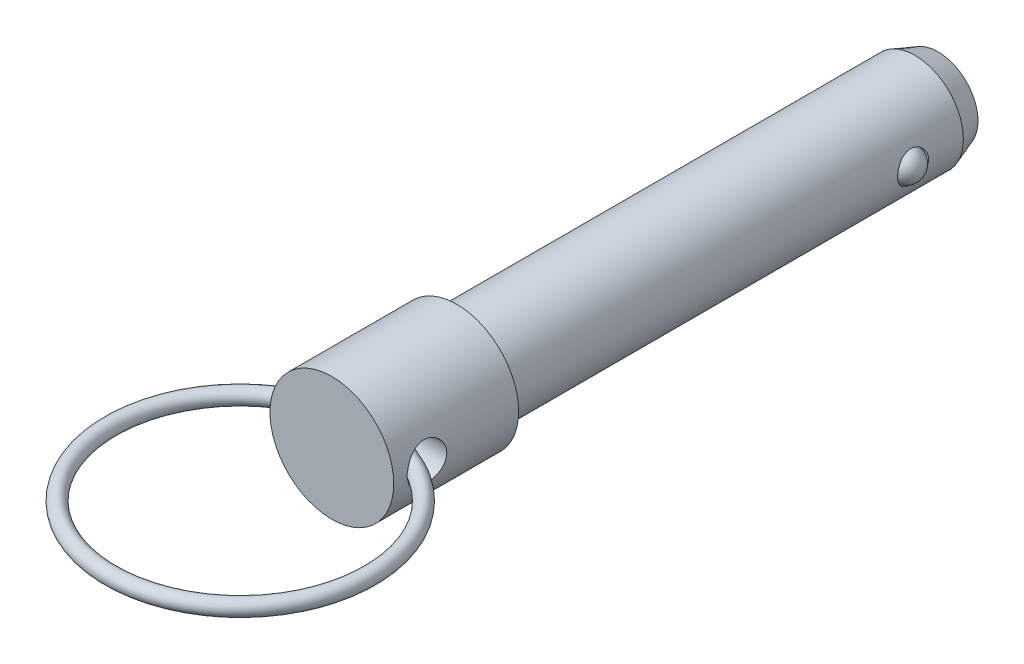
ISO-10303-21;
HEADER;
FILE_DESCRIPTION(('STEP AP214'),'2;1');
FILE_NAME('part.step','',(''),(''),'','','');
FILE_SCHEMA(('AUTOMOTIVE_DESIGN { 1 0 10303 214 1 1 1 1 }'));
ENDSEC;
DATA;
#1=APPLICATION_CONTEXT('core data for automotive mechanical design processes');
#2=APPLICATION_PROTOCOL_DEFINITION('international standard','automotive_design',2000,#1);
#3=PRODUCT_CONTEXT('',#1,'mechanical');
#4=PRODUCT('Part','Part','',(#3));
#5=PRODUCT_RELATED_PRODUCT_CATEGORY('part','',(#4));
#6=PRODUCT_DEFINITION_FORMATION('','',#4);
#7=PRODUCT_DEFINITION_CONTEXT('part definition',#1,'design');
#8=PRODUCT_DEFINITION('design','',#6,#7);
#9=PRODUCT_DEFINITION_SHAPE('','',#8);
#10=(LENGTH_UNIT() NAMED_UNIT(*) SI_UNIT(.MILLI.,.METRE.));
#11=(NAMED_UNIT(*) PLANE_ANGLE_UNIT() SI_UNIT($,.RADIAN.));
#12=(NAMED_UNIT(*) SI_UNIT($,.STERADIAN.) SOLID_ANGLE_UNIT());
#13=UNCERTAINTY_MEASURE_WITH_UNIT(LENGTH_MEASURE(1.E-05),#10,'distance_accuracy_value','');
#14=(GEOMETRIC_REPRESENTATION_CONTEXT(3) GLOBAL_UNCERTAINTY_ASSIGNED_CONTEXT((#13)) GLOBAL_UNIT_ASSIGNED_CONTEXT((#10,
#11,#12)) REPRESENTATION_CONTEXT('',''));
#15=CARTESIAN_POINT('',(0.,0.,0.));
#16=DIRECTION('',(0.,0.,1.));
#17=DIRECTION('',(1.,0.,0.));
#18=AXIS2_PLACEMENT_3D('',#15,#16,#17);
#19=CARTESIAN_POINT('',(7.9375,0.,9.398));
#20=DIRECTION('',(-1.,0.,0.));
#21=DIRECTION('',(0.,0.,-1.));
#22=AXIS2_PLACEMENT_3D('',#19,#20,#21);
#23=CYLINDRICAL_SURFACE('',#22,2.0193);
#24=CARTESIAN_POINT('',(-6.3502,0.292157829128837,11.3960531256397));
#25=CARTESIAN_POINT('',(-6.33446408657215,0.262361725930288,11.4004344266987));
#26=CARTESIAN_POINT('',(-6.32102794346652,0.231225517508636,11.4042829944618));
#27=CARTESIAN_POINT('',(-6.2992523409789,0.167152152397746,11.4106204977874));
#28=CARTESIAN_POINT('',(-6.29090461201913,0.13421801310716,11.413111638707));
#29=CARTESIAN_POINT('',(-6.27972917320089,0.0672091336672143,11.4164621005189));
#30=CARTESIAN_POINT('',(-6.27692077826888,0.0331308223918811,11.4173157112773));
#31=CARTESIAN_POINT('',(-6.27702601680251,-0.0350157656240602,11.4172838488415));
#32=CARTESIAN_POINT('',(-6.27993956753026,-0.0690840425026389,11.4163984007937));
#33=CARTESIAN_POINT('',(-6.2912662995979,-0.135748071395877,11.4130038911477));
#34=CARTESIAN_POINT('',(-6.29960976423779,-0.168356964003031,11.4105154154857));
#35=CARTESIAN_POINT('',(-6.32127848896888,-0.231802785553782,11.404211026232));
#36=CARTESIAN_POINT('',(-6.33461136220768,-0.2626369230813,11.4003930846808));
#37=CARTESIAN_POINT('',(-6.3502,-0.292157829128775,11.3960531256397));
#38=B_SPLINE_CURVE_WITH_KNOTS('',3,(#24,#25,#26,#27,#28,#29,#30,#31,#32,#33,#34,#35,#36,#37),
.UNSPECIFIED.,.F.,.F.,(4,2,2,2,2,2,4),(0.,0.101899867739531,0.203633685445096,0.305721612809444,
0.407808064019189,0.508608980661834,0.60956433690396),.UNSPECIFIED.);
#39=CARTESIAN_POINT('',(-6.3438349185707,0.279747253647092,11.3978284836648));
#40=VERTEX_POINT('',#39);
#41=CARTESIAN_POINT('',(-6.34383491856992,-0.279747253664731,11.3978284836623));
#42=VERTEX_POINT('',#41);
#43=EDGE_CURVE('E40',#40,#42,#38,.T.);
#44=ORIENTED_EDGE('',*,*,#43,.F.);
#45=CARTESIAN_POINT('',(-6.35,0.,11.4173));
#46=CARTESIAN_POINT('',(-6.34999578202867,-0.110312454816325,11.417293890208));
#47=CARTESIAN_POINT('',(-6.34709412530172,-0.22074185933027,11.4082188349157));
#48=CARTESIAN_POINT('',(-6.3357852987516,-0.438477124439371,11.3722159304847));
#49=CARTESIAN_POINT('',(-6.3273687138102,-0.545777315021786,11.3452575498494));
#50=CARTESIAN_POINT('',(-6.30595235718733,-0.753914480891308,11.2744960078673));
#51=CARTESIAN_POINT('',(-6.29296259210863,-0.854765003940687,11.2307296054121));
#52=CARTESIAN_POINT('',(-6.26374009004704,-1.04765917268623,11.1277235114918));
#53=CARTESIAN_POINT('',(-6.247507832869,-1.13970411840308,11.0684861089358));
#54=CARTESIAN_POINT('',(-6.21293601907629,-1.31536123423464,10.9342184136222));
#55=CARTESIAN_POINT('',(-6.19454917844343,-1.39865352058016,10.8587818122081));
#56=CARTESIAN_POINT('',(-6.15801023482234,-1.5516474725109,10.6951184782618));
#57=CARTESIAN_POINT('',(-6.13985819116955,-1.62134576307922,10.606888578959));
#58=CARTESIAN_POINT('',(-6.1053372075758,-1.74691684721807,10.4173629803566));
#59=CARTESIAN_POINT('',(-6.08902613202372,-1.80238797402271,10.315789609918));
#60=CARTESIAN_POINT('',(-6.06074349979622,-1.89532725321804,10.104153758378));
#61=CARTESIAN_POINT('',(-6.0487707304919,-1.93280043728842,9.99409365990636));
#62=CARTESIAN_POINT('',(-6.03101341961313,-1.98750760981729,9.77220930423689));
#63=CARTESIAN_POINT('',(-6.02504825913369,-2.00533395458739,9.66054596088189));
#64=CARTESIAN_POINT('',(-6.01944581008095,-2.02209234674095,9.43566621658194));
#65=CARTESIAN_POINT('',(-6.01980677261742,-2.02102961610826,9.32245025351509));
#66=CARTESIAN_POINT('',(-6.02665663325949,-2.00050250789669,9.10261826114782));
#67=CARTESIAN_POINT('',(-6.03289303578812,-1.98179631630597,8.99592223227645));
#68=CARTESIAN_POINT('',(-6.05038018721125,-1.92774435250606,8.78726894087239));
#69=CARTESIAN_POINT('',(-6.06163151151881,-1.89239667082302,8.68531222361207));
#70=CARTESIAN_POINT('',(-6.08807105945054,-1.80553890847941,8.48724541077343));
#71=CARTESIAN_POINT('',(-6.1033159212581,-1.75379385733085,8.39124624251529));
#72=CARTESIAN_POINT('',(-6.13599834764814,-1.63577635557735,8.20905256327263));
#73=CARTESIAN_POINT('',(-6.15343637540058,-1.56950083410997,8.12286013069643));
#74=CARTESIAN_POINT('',(-6.18954615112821,-1.42061516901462,7.95845350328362));
#75=CARTESIAN_POINT('',(-6.20823733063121,-1.33738288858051,7.88080597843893));
#76=CARTESIAN_POINT('',(-6.2440320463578,-1.15881168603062,7.74040227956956));
#77=CARTESIAN_POINT('',(-6.26113489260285,-1.0634675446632,7.6776525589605));
#78=CARTESIAN_POINT('',(-6.29201953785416,-0.86223092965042,7.56842117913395));
#79=CARTESIAN_POINT('',(-6.30576997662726,-0.756251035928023,7.5220914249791));
#80=CARTESIAN_POINT('',(-6.32815272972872,-0.537579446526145,7.448167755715));
#81=CARTESIAN_POINT('',(-6.3367955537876,-0.424902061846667,7.4205353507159));
#82=CARTESIAN_POINT('',(-6.34491251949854,-0.259333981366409,7.39474486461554));
#83=CARTESIAN_POINT('',(-6.3468148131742,-0.207677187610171,7.38873516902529));
#84=CARTESIAN_POINT('',(-6.34935954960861,-0.10402226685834,7.38071129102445));
#85=CARTESIAN_POINT('',(-6.35000198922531,-0.052024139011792,7.37869711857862));
#86=CARTESIAN_POINT('',(-6.34999578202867,0.110312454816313,7.37870610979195));
#87=CARTESIAN_POINT('',(-6.34709412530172,0.220741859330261,7.38778116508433));
#88=CARTESIAN_POINT('',(-6.3357852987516,0.438477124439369,7.42378406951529));
#89=CARTESIAN_POINT('',(-6.3273687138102,0.545777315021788,7.45074245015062));
#90=CARTESIAN_POINT('',(-6.30595235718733,0.753914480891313,7.5215039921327));
#91=CARTESIAN_POINT('',(-6.29296259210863,0.85476500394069,7.56527039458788));
#92=CARTESIAN_POINT('',(-6.26374009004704,1.04765917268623,7.66827648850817));
#93=CARTESIAN_POINT('',(-6.247507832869,1.13970411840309,7.72751389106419));
#94=CARTESIAN_POINT('',(-6.21293601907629,1.31536123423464,7.86178158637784));
#95=CARTESIAN_POINT('',(-6.19454917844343,1.39865352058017,7.93721818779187));
#96=CARTESIAN_POINT('',(-6.15801023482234,1.55164747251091,8.10088152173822));
#97=CARTESIAN_POINT('',(-6.13985819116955,1.62134576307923,8.18911142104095));
#98=CARTESIAN_POINT('',(-6.1053372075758,1.74691684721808,8.37863701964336));
#99=CARTESIAN_POINT('',(-6.08902613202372,1.80238797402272,8.48021039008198));
#100=CARTESIAN_POINT('',(-6.06074349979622,1.89532725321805,8.69184624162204));
#101=CARTESIAN_POINT('',(-6.0487707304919,1.93280043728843,8.80190634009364));
#102=CARTESIAN_POINT('',(-6.03101341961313,1.9875076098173,9.02379069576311));
#103=CARTESIAN_POINT('',(-6.02504825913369,2.0053339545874,9.13545403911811));
#104=CARTESIAN_POINT('',(-6.01944581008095,2.02209234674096,9.36033378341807));
#105=CARTESIAN_POINT('',(-6.01980677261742,2.02102961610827,9.47354974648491));
#106=CARTESIAN_POINT('',(-6.02665663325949,2.0005025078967,9.69338173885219));
#107=CARTESIAN_POINT('',(-6.03289303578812,1.98179631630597,9.80007776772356));
#108=CARTESIAN_POINT('',(-6.05038018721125,1.92774435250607,10.0087310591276));
#109=CARTESIAN_POINT('',(-6.06163151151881,1.89239667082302,10.1106877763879));
#110=CARTESIAN_POINT('',(-6.08807105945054,1.80553890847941,10.3087545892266));
#111=CARTESIAN_POINT('',(-6.1033159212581,1.75379385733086,10.4047537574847));
#112=CARTESIAN_POINT('',(-6.13599834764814,1.63577635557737,10.5869474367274));
#113=CARTESIAN_POINT('',(-6.15343637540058,1.56950083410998,10.6731398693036));
#114=CARTESIAN_POINT('',(-6.18954615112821,1.42061516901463,10.8375464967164));
#115=CARTESIAN_POINT('',(-6.20823733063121,1.33738288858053,10.9151940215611));
#116=CARTESIAN_POINT('',(-6.2440320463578,1.15881168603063,11.0555977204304));
#117=CARTESIAN_POINT('',(-6.26113489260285,1.06346754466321,11.1183474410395));
#118=CARTESIAN_POINT('',(-6.29201953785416,0.862230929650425,11.227578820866));
#119=CARTESIAN_POINT('',(-6.30576997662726,0.756251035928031,11.2739085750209));
#120=CARTESIAN_POINT('',(-6.32815272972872,0.537579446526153,11.347832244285));
#121=CARTESIAN_POINT('',(-6.3367955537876,0.424902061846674,11.3754646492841));
#122=CARTESIAN_POINT('',(-6.34491251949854,0.259333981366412,11.4012551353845));
#123=CARTESIAN_POINT('',(-6.3468148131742,0.207677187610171,11.4072648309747));
#124=CARTESIAN_POINT('',(-6.34935954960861,0.104022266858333,11.4152887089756));
#125=CARTESIAN_POINT('',(-6.35000198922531,0.0520241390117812,11.4173028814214));
#126=CARTESIAN_POINT('',(-6.35,0.,11.4173));
#127=B_SPLINE_CURVE_WITH_KNOTS('',3,(#45,#46,#47,#48,#49,#50,#51,#52,#53,#54,#55,#56,#57,#58,
#59,#60,#61,#62,#63,#64,#65,#66,#67,#68,#69,#70,#71,#72,#73,#74,#75,#76,#77,#78,#79,#80,#81,#82,
#83,#84,#85,#86,#87,#88,#89,#90,#91,#92,#93,#94,#95,#96,#97,#98,#99,#100,#101,#102,#103,#104,
#105,#106,#107,#108,#109,#110,#111,#112,#113,#114,#115,#116,#117,#118,#119,#120,#121,#122,#123,
#124,#125,#126),.UNSPECIFIED.,.T.,.F.,(4,2,2,2,2,2,2,2,2,2,2,2,2,2,2,2,2,2,2,2,2,2,2,2,2,2,2,2,
2,2,2,2,2,2,2,2,2,2,2,2,4),(0.,0.33073688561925,0.662039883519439,0.992622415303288,
1.32315606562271,1.66322530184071,2.00337886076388,2.35228054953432,2.70108463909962,
3.0390572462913,3.37693642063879,3.70092724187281,4.02495524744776,4.35385413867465,
4.68282260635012,5.02727904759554,5.37188442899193,5.71959937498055,6.06659632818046,
6.22257380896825,6.37855167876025,6.70928856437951,7.04059156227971,7.37117409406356,
7.70170774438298,8.04177698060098,8.38193053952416,8.73083222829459,9.07963631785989,
9.41760892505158,9.75548809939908,10.0794789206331,10.403506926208,10.7324058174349,
11.0613742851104,11.4058307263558,11.7504361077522,12.0981510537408,12.4451480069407,
12.6011254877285,12.7571033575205),.UNSPECIFIED.);
#128=EDGE_CURVE('E66',#42,#40,#127,.T.);
#129=ORIENTED_EDGE('',*,*,#128,.F.);
#130=EDGE_LOOP('',(#44,#129));
#131=FACE_BOUND('',#130,.T.);
#132=CARTESIAN_POINT('',(6.3502,-0.292157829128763,11.3960531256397));
#133=CARTESIAN_POINT('',(6.33446408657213,-0.262361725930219,11.4004344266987));
#134=CARTESIAN_POINT('',(6.3210279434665,-0.231225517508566,11.4042829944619));
#135=CARTESIAN_POINT('',(6.29925234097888,-0.167152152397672,11.4106204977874));
#136=CARTESIAN_POINT('',(6.29090461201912,-0.134218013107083,11.413111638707));
#137=CARTESIAN_POINT('',(6.27972917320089,-0.0672091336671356,11.4164621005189));
#138=CARTESIAN_POINT('',(6.27692077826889,-0.0331308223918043,11.4173157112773));
#139=CARTESIAN_POINT('',(6.27702601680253,0.0350157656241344,11.4172838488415));
#140=CARTESIAN_POINT('',(6.27993956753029,0.0690840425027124,11.4163984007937));
#141=CARTESIAN_POINT('',(6.29126629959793,0.135748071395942,11.4130038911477));
#142=CARTESIAN_POINT('',(6.29960976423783,0.168356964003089,11.4105154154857));
#143=CARTESIAN_POINT('',(6.32127848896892,0.23180278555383,11.4042110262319));
#144=CARTESIAN_POINT('',(6.33461136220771,0.262636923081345,11.4003930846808));
#145=CARTESIAN_POINT('',(6.3502,0.292157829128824,11.3960531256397));
#146=B_SPLINE_CURVE_WITH_KNOTS('',3,(#132,#133,#134,#135,#136,#137,#138,#139,#140,#141,#142,
#143,#144,#145),.UNSPECIFIED.,.F.,.F.,(4,2,2,2,2,2,4),(0.,0.101899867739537,0.203633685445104,
0.305721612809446,0.40780806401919,0.508608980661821,0.609564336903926),.UNSPECIFIED.);
#147=CARTESIAN_POINT('',(6.3438349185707,-0.279747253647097,11.3978284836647));
#148=VERTEX_POINT('',#147);
#149=CARTESIAN_POINT('',(6.3438349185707,0.279747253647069,11.3978284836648));
#150=VERTEX_POINT('',#149);
#151=EDGE_CURVE('E33',#148,#150,#146,.T.);
#152=ORIENTED_EDGE('',*,*,#151,.F.);
#153=CARTESIAN_POINT('',(6.35,0.,7.3787));
#154=CARTESIAN_POINT('',(6.34999578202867,-0.110312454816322,7.37870610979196));
#155=CARTESIAN_POINT('',(6.34709412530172,-0.220741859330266,7.38778116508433));
#156=CARTESIAN_POINT('',(6.3357852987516,-0.438477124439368,7.42378406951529));
#157=CARTESIAN_POINT('',(6.32736871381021,-0.545777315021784,7.45074245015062));
#158=CARTESIAN_POINT('',(6.30595235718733,-0.753914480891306,7.5215039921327));
#159=CARTESIAN_POINT('',(6.29296259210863,-0.854765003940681,7.56527039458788));
#160=CARTESIAN_POINT('',(6.26374009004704,-1.04765917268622,7.66827648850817));
#161=CARTESIAN_POINT('',(6.24750783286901,-1.13970411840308,7.72751389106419));
#162=CARTESIAN_POINT('',(6.2129360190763,-1.31536123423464,7.86178158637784));
#163=CARTESIAN_POINT('',(6.19454917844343,-1.39865352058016,7.93721818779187));
#164=CARTESIAN_POINT('',(6.15801023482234,-1.5516474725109,8.10088152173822));
#165=CARTESIAN_POINT('',(6.13985819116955,-1.62134576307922,8.18911142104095));
#166=CARTESIAN_POINT('',(6.1053372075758,-1.74691684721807,8.37863701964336));
#167=CARTESIAN_POINT('',(6.08902613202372,-1.80238797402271,8.48021039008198));
#168=CARTESIAN_POINT('',(6.06074349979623,-1.89532725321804,8.69184624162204));
#169=CARTESIAN_POINT('',(6.04877073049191,-1.93280043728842,8.80190634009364));
#170=CARTESIAN_POINT('',(6.03101341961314,-1.9875076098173,9.02379069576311));
#171=CARTESIAN_POINT('',(6.02504825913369,-2.00533395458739,9.13545403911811));
#172=CARTESIAN_POINT('',(6.01944581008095,-2.02209234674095,9.36033378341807));
#173=CARTESIAN_POINT('',(6.01980677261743,-2.02102961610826,9.47354974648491));
#174=CARTESIAN_POINT('',(6.0266566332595,-2.00050250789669,9.69338173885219));
#175=CARTESIAN_POINT('',(6.03289303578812,-1.98179631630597,9.80007776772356));
#176=CARTESIAN_POINT('',(6.05038018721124,-1.92774435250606,10.0087310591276));
#177=CARTESIAN_POINT('',(6.06163151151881,-1.89239667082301,10.1106877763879));
#178=CARTESIAN_POINT('',(6.08807105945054,-1.80553890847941,10.3087545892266));
#179=CARTESIAN_POINT('',(6.1033159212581,-1.75379385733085,10.4047537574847));
#180=CARTESIAN_POINT('',(6.13599834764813,-1.63577635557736,10.5869474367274));
#181=CARTESIAN_POINT('',(6.15343637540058,-1.56950083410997,10.6731398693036));
#182=CARTESIAN_POINT('',(6.18954615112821,-1.42061516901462,10.8375464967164));
#183=CARTESIAN_POINT('',(6.2082373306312,-1.33738288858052,10.9151940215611));
#184=CARTESIAN_POINT('',(6.2440320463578,-1.15881168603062,11.0555977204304));
#185=CARTESIAN_POINT('',(6.26113489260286,-1.0634675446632,11.1183474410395));
#186=CARTESIAN_POINT('',(6.29201953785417,-0.862230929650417,11.227578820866));
#187=CARTESIAN_POINT('',(6.30576997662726,-0.756251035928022,11.2739085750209));
#188=CARTESIAN_POINT('',(6.32815272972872,-0.537579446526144,11.347832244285));
#189=CARTESIAN_POINT('',(6.33679555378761,-0.424902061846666,11.3754646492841));
#190=CARTESIAN_POINT('',(6.34491251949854,-0.259333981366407,11.4012551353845));
#191=CARTESIAN_POINT('',(6.3468148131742,-0.207677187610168,11.4072648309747));
#192=CARTESIAN_POINT('',(6.34935954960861,-0.104022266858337,11.4152887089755));
#193=CARTESIAN_POINT('',(6.35000198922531,-0.0520241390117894,11.4173028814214));
#194=CARTESIAN_POINT('',(6.34999578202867,0.110312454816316,11.417293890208));
#195=CARTESIAN_POINT('',(6.34709412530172,0.220741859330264,11.4082188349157));
#196=CARTESIAN_POINT('',(6.3357852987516,0.438477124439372,11.3722159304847));
#197=CARTESIAN_POINT('',(6.32736871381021,0.545777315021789,11.3452575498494));
#198=CARTESIAN_POINT('',(6.30595235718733,0.753914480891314,11.2744960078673));
#199=CARTESIAN_POINT('',(6.29296259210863,0.854765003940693,11.2307296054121));
#200=CARTESIAN_POINT('',(6.26374009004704,1.04765917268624,11.1277235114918));
#201=CARTESIAN_POINT('',(6.24750783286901,1.13970411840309,11.0684861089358));
#202=CARTESIAN_POINT('',(6.2129360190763,1.31536123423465,10.9342184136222));
#203=CARTESIAN_POINT('',(6.19454917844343,1.39865352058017,10.8587818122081));
#204=CARTESIAN_POINT('',(6.15801023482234,1.55164747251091,10.6951184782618));
#205=CARTESIAN_POINT('',(6.13985819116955,1.62134576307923,10.606888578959));
#206=CARTESIAN_POINT('',(6.1053372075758,1.74691684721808,10.4173629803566));
#207=CARTESIAN_POINT('',(6.08902613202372,1.80238797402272,10.315789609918));
#208=CARTESIAN_POINT('',(6.06074349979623,1.89532725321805,10.104153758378));
#209=CARTESIAN_POINT('',(6.04877073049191,1.93280043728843,9.99409365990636));
#210=CARTESIAN_POINT('',(6.03101341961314,1.9875076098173,9.77220930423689));
#211=CARTESIAN_POINT('',(6.02504825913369,2.0053339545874,9.66054596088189));
#212=CARTESIAN_POINT('',(6.01944581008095,2.02209234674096,9.43566621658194));
#213=CARTESIAN_POINT('',(6.01980677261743,2.02102961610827,9.3224502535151));
#214=CARTESIAN_POINT('',(6.0266566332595,2.00050250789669,9.10261826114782));
#215=CARTESIAN_POINT('',(6.03289303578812,1.98179631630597,8.99592223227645));
#216=CARTESIAN_POINT('',(6.05038018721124,1.92774435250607,8.78726894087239));
#217=CARTESIAN_POINT('',(6.06163151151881,1.89239667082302,8.68531222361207));
#218=CARTESIAN_POINT('',(6.08807105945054,1.80553890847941,8.48724541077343));
#219=CARTESIAN_POINT('',(6.1033159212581,1.75379385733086,8.39124624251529));
#220=CARTESIAN_POINT('',(6.13599834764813,1.63577635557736,8.20905256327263));
#221=CARTESIAN_POINT('',(6.15343637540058,1.56950083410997,8.12286013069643));
#222=CARTESIAN_POINT('',(6.18954615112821,1.42061516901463,7.95845350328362));
#223=CARTESIAN_POINT('',(6.2082373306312,1.33738288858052,7.88080597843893));
#224=CARTESIAN_POINT('',(6.2440320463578,1.15881168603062,7.74040227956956));
#225=CARTESIAN_POINT('',(6.26113489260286,1.06346754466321,7.6776525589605));
#226=CARTESIAN_POINT('',(6.29201953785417,0.862230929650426,7.56842117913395));
#227=CARTESIAN_POINT('',(6.30576997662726,0.756251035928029,7.5220914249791));
#228=CARTESIAN_POINT('',(6.32815272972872,0.537579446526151,7.448167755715));
#229=CARTESIAN_POINT('',(6.33679555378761,0.424902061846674,7.4205353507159));
#230=CARTESIAN_POINT('',(6.34491251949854,0.259333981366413,7.39474486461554));
#231=CARTESIAN_POINT('',(6.3468148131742,0.207677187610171,7.38873516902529));
#232=CARTESIAN_POINT('',(6.34935954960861,0.104022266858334,7.38071129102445));
#233=CARTESIAN_POINT('',(6.35000198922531,0.0520241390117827,7.37869711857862));
#234=CARTESIAN_POINT('',(6.35,0.,7.3787));
#235=B_SPLINE_CURVE_WITH_KNOTS('',3,(#153,#154,#155,#156,#157,#158,#159,#160,#161,#162,#163,
#164,#165,#166,#167,#168,#169,#170,#171,#172,#173,#174,#175,#176,#177,#178,#179,#180,#181,#182,
#183,#184,#185,#186,#187,#188,#189,#190,#191,#192,#193,#194,#195,#196,#197,#198,#199,#200,#201,
#202,#203,#204,#205,#206,#207,#208,#209,#210,#211,#212,#213,#214,#215,#216,#217,#218,#219,#220,
#221,#222,#223,#224,#225,#226,#227,#228,#229,#230,#231,#232,#233,#234),.UNSPECIFIED.,.T.,.F.,(4,
2,2,2,2,2,2,2,2,2,2,2,2,2,2,2,2,2,2,2,2,2,2,2,2,2,2,2,2,2,2,2,2,2,2,2,2,2,2,2,4),(0.,
0.330736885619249,0.662039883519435,0.992622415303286,1.32315606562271,1.66322530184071,
2.00337886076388,2.35228054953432,2.70108463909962,3.03905724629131,3.3769364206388,
3.70092724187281,4.02495524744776,4.35385413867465,4.68282260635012,5.02727904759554,
5.37188442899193,5.71959937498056,6.06659632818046,6.22257380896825,6.37855167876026,
6.70928856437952,7.04059156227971,7.37117409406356,7.70170774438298,8.04177698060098,
8.38193053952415,8.73083222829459,9.07963631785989,9.41760892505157,9.75548809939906,
10.0794789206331,10.403506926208,10.7324058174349,11.0613742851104,11.4058307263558,
11.7504361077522,12.0981510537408,12.4451480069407,12.6011254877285,12.7571033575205),.UNSPECIFIED.);
#236=EDGE_CURVE('E62',#150,#148,#235,.T.);
#237=ORIENTED_EDGE('',*,*,#236,.F.);
#238=EDGE_LOOP('',(#152,#237));
#239=FACE_BOUND('',#238,.T.);
#240=ADVANCED_FACE('F14',(#131,#239),#23,.F.);
#241=CARTESIAN_POINT('',(0.,0.,-34.39922));
#242=DIRECTION('',(0.,0.,-1.));
#243=DIRECTION('',(1.,0.,0.));
#244=AXIS2_PLACEMENT_3D('',#241,#242,#243);
#245=CYLINDRICAL_SURFACE('',#244,6.35);
#246=ORIENTED_EDGE('',*,*,#236,.T.);
#247=CARTESIAN_POINT('',(6.34665582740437,-0.206057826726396,9.6663673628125));
#248=CARTESIAN_POINT('',(6.34528498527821,-0.248279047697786,9.67828523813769));
#249=CARTESIAN_POINT('',(6.34352249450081,-0.289459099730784,9.69386090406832));
#250=CARTESIAN_POINT('',(6.33942011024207,-0.368543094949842,9.7317801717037));
#251=CARTESIAN_POINT('',(6.33708008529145,-0.406446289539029,9.75412531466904));
#252=CARTESIAN_POINT('',(6.33209241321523,-0.477899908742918,9.8047666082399));
#253=CARTESIAN_POINT('',(6.32944535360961,-0.511458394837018,9.83305147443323));
#254=CARTESIAN_POINT('',(6.32412241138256,-0.573540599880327,9.89467297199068));
#255=CARTESIAN_POINT('',(6.32144652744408,-0.602064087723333,9.92800983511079));
#256=CARTESIAN_POINT('',(6.31623478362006,-0.654523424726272,10.0000464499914));
#257=CARTESIAN_POINT('',(6.31370785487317,-0.678248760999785,10.0388997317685));
#258=CARTESIAN_POINT('',(6.30914807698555,-0.719430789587,10.1198151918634));
#259=CARTESIAN_POINT('',(6.30711537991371,-0.736885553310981,10.1618783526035));
#260=CARTESIAN_POINT('',(6.30356963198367,-0.76665206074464,10.2517585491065));
#261=CARTESIAN_POINT('',(6.3021147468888,-0.778407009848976,10.2997618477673));
#262=CARTESIAN_POINT('',(6.30009638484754,-0.794575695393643,10.3969997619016));
#263=CARTESIAN_POINT('',(6.2995332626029,-0.798986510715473,10.4462348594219));
#264=CARTESIAN_POINT('',(6.29930439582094,-0.800791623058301,10.5499764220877));
#265=CARTESIAN_POINT('',(6.29973840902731,-0.79740583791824,10.6044969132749));
#266=CARTESIAN_POINT('',(6.30162771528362,-0.782332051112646,10.7123814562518));
#267=CARTESIAN_POINT('',(6.30308376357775,-0.770637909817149,10.7657446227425));
#268=CARTESIAN_POINT('',(6.30699495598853,-0.737976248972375,10.8743575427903));
#269=CARTESIAN_POINT('',(6.30952256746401,-0.716323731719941,10.9294001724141));
#270=CARTESIAN_POINT('',(6.31524450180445,-0.663986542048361,11.0349896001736));
#271=CARTESIAN_POINT('',(6.31843852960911,-0.633305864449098,11.0855383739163));
#272=CARTESIAN_POINT('',(6.32446092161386,-0.569663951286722,11.1714846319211));
#273=CARTESIAN_POINT('',(6.3272488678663,-0.538153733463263,11.2079604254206));
#274=CARTESIAN_POINT('',(6.33270636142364,-0.469583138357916,11.2752665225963));
#275=CARTESIAN_POINT('',(6.3353760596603,-0.432530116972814,11.3061041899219));
#276=CARTESIAN_POINT('',(6.33987873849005,-0.359908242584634,11.3561064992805));
#277=CARTESIAN_POINT('',(6.34177713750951,-0.325092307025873,11.3763560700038));
#278=CARTESIAN_POINT('',(6.34507913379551,-0.252556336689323,11.4108259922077));
#279=CARTESIAN_POINT('',(6.34648300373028,-0.214837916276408,11.4250496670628));
#280=CARTESIAN_POINT('',(6.34863622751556,-0.137224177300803,11.446638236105));
#281=CARTESIAN_POINT('',(6.34938200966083,-0.0973182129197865,11.4539657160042));
#282=CARTESIAN_POINT('',(6.35010496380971,-0.0168334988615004,11.4610716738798));
#283=CARTESIAN_POINT('',(6.35008242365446,0.0237449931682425,11.4608529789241));
#284=CARTESIAN_POINT('',(6.34931136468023,0.100393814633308,11.4532686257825));
#285=CARTESIAN_POINT('',(6.34863038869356,0.136533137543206,11.4465678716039));
#286=CARTESIAN_POINT('',(6.3467164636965,0.207223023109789,11.4274006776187));
#287=CARTESIAN_POINT('',(6.34548344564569,0.241773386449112,11.4149335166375));
#288=CARTESIAN_POINT('',(6.34254165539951,0.309606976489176,11.3844132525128));
#289=CARTESIAN_POINT('',(6.34081891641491,0.342814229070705,11.3661941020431));
#290=CARTESIAN_POINT('',(6.33707366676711,0.406211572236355,11.3251453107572));
#291=CARTESIAN_POINT('',(6.33505103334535,0.436400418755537,11.3023137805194));
#292=CARTESIAN_POINT('',(6.33055131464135,0.497695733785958,11.2491439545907));
#293=CARTESIAN_POINT('',(6.32805141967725,0.528268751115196,11.2181940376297));
#294=CARTESIAN_POINT('',(6.32308163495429,0.584759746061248,11.1523092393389));
#295=CARTESIAN_POINT('',(6.32061176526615,0.610674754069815,11.1173718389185));
#296=CARTESIAN_POINT('',(6.315456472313,0.662038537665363,11.0376631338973));
#297=CARTESIAN_POINT('',(6.31281513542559,0.686522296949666,10.9922657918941));
#298=CARTESIAN_POINT('',(6.30810097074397,0.72856661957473,10.8983369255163));
#299=CARTESIAN_POINT('',(6.30602851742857,0.746122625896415,10.8498033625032));
#300=CARTESIAN_POINT('',(6.30243933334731,0.775896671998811,10.7442183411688));
#301=CARTESIAN_POINT('',(6.30103001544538,0.787122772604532,10.6868803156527));
#302=CARTESIAN_POINT('',(6.29940721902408,0.800007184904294,10.5710986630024));
#303=CARTESIAN_POINT('',(6.29919407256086,0.801662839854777,10.5126547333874));
#304=CARTESIAN_POINT('',(6.30005021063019,0.794909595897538,10.3956729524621));
#305=CARTESIAN_POINT('',(6.30113381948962,0.786388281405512,10.3371413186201));
#306=CARTESIAN_POINT('',(6.30452399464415,0.758730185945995,10.2226628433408));
#307=CARTESIAN_POINT('',(6.30682981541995,0.739599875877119,10.1667144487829));
#308=CARTESIAN_POINT('',(6.31212037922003,0.692916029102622,10.0644672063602));
#309=CARTESIAN_POINT('',(6.31502617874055,0.666266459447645,10.0177527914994));
#310=CARTESIAN_POINT('',(6.32122790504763,0.604592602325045,9.93024699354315));
#311=CARTESIAN_POINT('',(6.32452352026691,0.569574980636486,9.88945093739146));
#312=CARTESIAN_POINT('',(6.33066231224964,0.496394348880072,9.8196791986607));
#313=CARTESIAN_POINT('',(6.3335154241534,0.458999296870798,9.78989736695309));
#314=CARTESIAN_POINT('',(6.33878167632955,0.379383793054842,9.7376345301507));
#315=CARTESIAN_POINT('',(6.34119502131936,0.337165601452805,9.71515012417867));
#316=CARTESIAN_POINT('',(6.34510608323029,0.25255894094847,9.67976956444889));
#317=CARTESIAN_POINT('',(6.3466587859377,0.210419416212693,9.66628201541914));
#318=CARTESIAN_POINT('',(6.34892624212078,0.124425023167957,9.64681261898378));
#319=CARTESIAN_POINT('',(6.34964132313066,0.0805708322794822,9.64082783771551));
#320=CARTESIAN_POINT('',(6.35013003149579,-0.00429887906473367,9.63672685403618));
#321=CARTESIAN_POINT('',(6.3499683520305,-0.0452888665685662,9.63806999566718));
#322=CARTESIAN_POINT('',(6.34886964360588,-0.126506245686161,9.64734016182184));
#323=CARTESIAN_POINT('',(6.34793260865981,-0.166733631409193,9.65526723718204));
#324=CARTESIAN_POINT('',(6.34665582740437,-0.206057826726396,9.6663673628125));
#325=B_SPLINE_CURVE_WITH_KNOTS('',3,(#247,#248,#249,#250,#251,#252,#253,#254,#255,#256,#257,
#258,#259,#260,#261,#262,#263,#264,#265,#266,#267,#268,#269,#270,#271,#272,#273,#274,#275,#276,
#277,#278,#279,#280,#281,#282,#283,#284,#285,#286,#287,#288,#289,#290,#291,#292,#293,#294,#295,
#296,#297,#298,#299,#300,#301,#302,#303,#304,#305,#306,#307,#308,#309,#310,#311,#312,#313,#314,
#315,#316,#317,#318,#319,#320,#321,#322,#323,#324),.UNSPECIFIED.,.T.,.F.,(4,2,2,2,2,2,2,2,2,2,2,
2,2,2,2,2,2,2,2,2,2,2,2,2,2,2,2,2,2,2,2,2,2,2,2,2,2,2,4),(0.,0.131523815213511,0.26307759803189,
0.394383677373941,0.525695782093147,0.661900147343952,0.798146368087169,0.945864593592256,
1.09364155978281,1.25683680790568,1.42015277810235,1.59693202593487,1.7736331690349,
1.91791685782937,2.06201073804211,2.18247669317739,2.3028761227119,2.4239250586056,
2.54492864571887,2.65470676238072,2.76449861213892,2.87780525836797,2.99115841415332,
3.12140054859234,3.25172542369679,3.40605418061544,3.56048428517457,3.73501068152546,
3.90958552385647,4.08610670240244,4.26252033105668,4.42319186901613,4.58373584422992,
4.72664586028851,4.86948917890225,5.00164792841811,5.13375498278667,5.25625329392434,
5.37875255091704),.UNSPECIFIED.);
#326=EDGE_CURVE('E27',#148,#150,#325,.T.);
#327=ORIENTED_EDGE('',*,*,#326,.T.);
#328=EDGE_LOOP('',(#246,#327));
#329=FACE_BOUND('',#328,.T.);
#330=CARTESIAN_POINT('',(0.,0.,12.8270000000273));
#331=DIRECTION('',(0.,0.,-1.));
#332=DIRECTION('',(1.,0.,0.));
#333=AXIS2_PLACEMENT_3D('',#330,#331,#332);
#334=CIRCLE('',#333,6.34999999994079);
#335=CARTESIAN_POINT('',(6.34999999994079,0.,12.8270000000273));
#336=VERTEX_POINT('',#335);
#337=EDGE_CURVE('E71',#336,#336,#334,.T.);
#338=ORIENTED_EDGE('',*,*,#337,.T.);
#339=EDGE_LOOP('',(#338));
#340=FACE_BOUND('',#339,.T.);
#341=CARTESIAN_POINT('',(0.,0.,1.16018306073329E-11));
#342=DIRECTION('',(0.,0.,-1.));
#343=DIRECTION('',(1.,0.,0.));
#344=AXIS2_PLACEMENT_3D('',#341,#342,#343);
#345=CIRCLE('',#344,6.34999999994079);
#346=CARTESIAN_POINT('',(6.34999999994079,0.,1.16015507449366E-11));
#347=VERTEX_POINT('',#346);
#348=EDGE_CURVE('E279',#347,#347,#345,.T.);
#349=ORIENTED_EDGE('',*,*,#348,.F.);
#350=EDGE_LOOP('',(#349));
#351=FACE_BOUND('',#350,.T.);
#352=ORIENTED_EDGE('',*,*,#128,.T.);
#353=CARTESIAN_POINT('',(-6.34665582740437,-0.206057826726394,9.66636736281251));
#354=CARTESIAN_POINT('',(-6.34797934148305,-0.165285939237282,9.65485950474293));
#355=CARTESIAN_POINT('',(-6.34893816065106,-0.123532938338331,9.64675937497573));
#356=CARTESIAN_POINT('',(-6.35001869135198,-0.0392395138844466,9.63764831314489));
#357=CARTESIAN_POINT('',(-6.35014017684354,0.00330111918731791,9.63663929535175));
#358=CARTESIAN_POINT('',(-6.34953206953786,0.0879394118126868,9.64174776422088));
#359=CARTESIAN_POINT('',(-6.34880260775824,0.130037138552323,9.6478641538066));
#360=CARTESIAN_POINT('',(-6.34657447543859,0.212600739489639,9.66701677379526));
#361=CARTESIAN_POINT('',(-6.34507584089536,0.253066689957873,9.68005268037));
#362=CARTESIAN_POINT('',(-6.34146900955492,0.331381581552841,9.7126623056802));
#363=CARTESIAN_POINT('',(-6.33935898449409,0.369222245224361,9.73225566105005));
#364=CARTESIAN_POINT('',(-6.33475813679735,0.441182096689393,9.77733154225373));
#365=CARTESIAN_POINT('',(-6.33226728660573,0.4753010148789,9.80281449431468));
#366=CARTESIAN_POINT('',(-6.32708436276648,0.539990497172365,9.85971055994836));
#367=CARTESIAN_POINT('',(-6.32438850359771,0.570424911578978,9.89127784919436));
#368=CARTESIAN_POINT('',(-6.31913817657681,0.62591663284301,9.95882994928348));
#369=CARTESIAN_POINT('',(-6.31658374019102,0.650972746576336,9.9948157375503));
#370=CARTESIAN_POINT('',(-6.31170869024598,0.696703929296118,10.0724886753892));
#371=CARTESIAN_POINT('',(-6.30941195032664,0.717017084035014,10.1143899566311));
#372=CARTESIAN_POINT('',(-6.30545539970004,0.75101620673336,10.2008200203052));
#373=CARTESIAN_POINT('',(-6.30379582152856,0.764699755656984,10.245349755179));
#374=CARTESIAN_POINT('',(-6.30112261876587,0.786439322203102,10.3401349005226));
#375=CARTESIAN_POINT('',(-6.30018307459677,0.793856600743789,10.3905385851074));
#376=CARTESIAN_POINT('',(-6.29927265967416,0.801046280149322,10.4918905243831));
#377=CARTESIAN_POINT('',(-6.29930218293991,0.800815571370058,10.5428389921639));
#378=CARTESIAN_POINT('',(-6.3003424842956,0.792594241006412,10.6494235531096));
#379=CARTESIAN_POINT('',(-6.30145478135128,0.783800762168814,10.7049973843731));
#380=CARTESIAN_POINT('',(-6.30465473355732,0.757628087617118,10.8140964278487));
#381=CARTESIAN_POINT('',(-6.30674324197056,0.740241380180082,10.8676198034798));
#382=CARTESIAN_POINT('',(-6.31179783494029,0.695872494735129,10.9743734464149));
#383=CARTESIAN_POINT('',(-6.31480965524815,0.66836998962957,11.0273869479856));
#384=CARTESIAN_POINT('',(-6.32125797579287,0.604341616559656,11.127620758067));
#385=CARTESIAN_POINT('',(-6.32469393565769,0.56782717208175,11.1748482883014));
#386=CARTESIAN_POINT('',(-6.33064540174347,0.496358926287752,11.2504526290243));
#387=CARTESIAN_POINT('',(-6.33317742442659,0.463272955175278,11.2805972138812));
#388=CARTESIAN_POINT('',(-6.33795112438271,0.392589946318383,11.3350975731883));
#389=CARTESIAN_POINT('',(-6.34019298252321,0.354995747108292,11.3594569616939));
#390=CARTESIAN_POINT('',(-6.34414022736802,0.275631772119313,11.4012144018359));
#391=CARTESIAN_POINT('',(-6.34584084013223,0.233828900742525,11.418550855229));
#392=CARTESIAN_POINT('',(-6.3484301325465,0.147595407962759,11.4446164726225));
#393=CARTESIAN_POINT('',(-6.34931975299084,0.103167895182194,11.4533556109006));
#394=CARTESIAN_POINT('',(-6.35008514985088,0.0199378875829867,11.4608753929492));
#395=CARTESIAN_POINT('',(-6.35008843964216,-0.0187536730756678,11.4609085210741));
#396=CARTESIAN_POINT('',(-6.34939746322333,-0.095517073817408,11.4541183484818));
#397=CARTESIAN_POINT('',(-6.34870331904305,-0.133589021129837,11.4472962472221));
#398=CARTESIAN_POINT('',(-6.34675486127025,-0.2060356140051,11.4277870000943));
#399=CARTESIAN_POINT('',(-6.34553149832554,-0.24049959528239,11.4154227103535));
#400=CARTESIAN_POINT('',(-6.34265636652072,-0.30712135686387,11.3856122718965));
#401=CARTESIAN_POINT('',(-6.34100449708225,-0.339278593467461,11.3681649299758));
#402=CARTESIAN_POINT('',(-6.33723692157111,-0.40382570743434,11.3269948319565));
#403=CARTESIAN_POINT('',(-6.33509154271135,-0.435925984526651,11.3028229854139));
#404=CARTESIAN_POINT('',(-6.33064272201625,-0.496369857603,11.250192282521));
#405=CARTESIAN_POINT('',(-6.32833919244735,-0.524711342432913,11.2217310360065));
#406=CARTESIAN_POINT('',(-6.32334030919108,-0.582098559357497,11.1560085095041));
#407=CARTESIAN_POINT('',(-6.3206477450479,-0.610381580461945,11.118081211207));
#408=CARTESIAN_POINT('',(-6.31552631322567,-0.661272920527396,11.0385798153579));
#409=CARTESIAN_POINT('',(-6.31309762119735,-0.683877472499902,10.9970033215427));
#410=CARTESIAN_POINT('',(-6.30833642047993,-0.726588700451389,10.9038901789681));
#411=CARTESIAN_POINT('',(-6.30608942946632,-0.745628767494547,10.8518572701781));
#412=CARTESIAN_POINT('',(-6.30248979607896,-0.775466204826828,10.7454330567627));
#413=CARTESIAN_POINT('',(-6.30113765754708,-0.786258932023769,10.69104044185));
#414=CARTESIAN_POINT('',(-6.29944352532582,-0.799728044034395,10.5770263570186));
#415=CARTESIAN_POINT('',(-6.29918591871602,-0.80172680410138,10.5173211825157));
#416=CARTESIAN_POINT('',(-6.30000525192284,-0.795264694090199,10.3984664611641));
#417=CARTESIAN_POINT('',(-6.30108195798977,-0.786805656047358,10.3393168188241));
#418=CARTESIAN_POINT('',(-6.30440515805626,-0.759704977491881,10.2262823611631));
#419=CARTESIAN_POINT('',(-6.30659553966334,-0.741549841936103,10.1722805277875));
#420=CARTESIAN_POINT('',(-6.31185428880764,-0.695364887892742,10.068707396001));
#421=CARTESIAN_POINT('',(-6.31492202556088,-0.667342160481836,10.0191329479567));
#422=CARTESIAN_POINT('',(-6.32113146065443,-0.605515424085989,9.9316897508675));
#423=CARTESIAN_POINT('',(-6.32422841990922,-0.572678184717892,9.89313380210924));
#424=CARTESIAN_POINT('',(-6.33035789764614,-0.500375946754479,9.82285661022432));
#425=CARTESIAN_POINT('',(-6.3333904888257,-0.460918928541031,9.79112724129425));
#426=CARTESIAN_POINT('',(-6.33833786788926,-0.386069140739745,9.74204682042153));
#427=CARTESIAN_POINT('',(-6.34035098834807,-0.351739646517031,9.72306715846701));
#428=CARTESIAN_POINT('',(-6.34389840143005,-0.280571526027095,9.69054512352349));
#429=CARTESIAN_POINT('',(-6.3454328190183,-0.243733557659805,9.67700133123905));
#430=CARTESIAN_POINT('',(-6.34665582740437,-0.206057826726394,9.66636736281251));
#431=B_SPLINE_CURVE_WITH_KNOTS('',3,(#353,#354,#355,#356,#357,#358,#359,#360,#361,#362,#363,
#364,#365,#366,#367,#368,#369,#370,#371,#372,#373,#374,#375,#376,#377,#378,#379,#380,#381,#382,
#383,#384,#385,#386,#387,#388,#389,#390,#391,#392,#393,#394,#395,#396,#397,#398,#399,#400,#401,
#402,#403,#404,#405,#406,#407,#408,#409,#410,#411,#412,#413,#414,#415,#416,#417,#418,#419,#420,
#421,#422,#423,#424,#425,#426,#427,#428,#429,#430),.UNSPECIFIED.,.T.,.F.,(4,2,2,2,2,2,2,2,2,2,2,
2,2,2,2,2,2,2,2,2,2,2,2,2,2,2,2,2,2,2,2,2,2,2,2,2,2,2,4),(0.,0.127017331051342,0.25406894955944,
0.381101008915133,0.508127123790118,0.635537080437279,0.762956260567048,0.894175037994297,
1.0254228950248,1.16470220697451,1.30403230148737,1.45626942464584,1.60856844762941,
1.77667342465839,1.94492561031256,2.12343441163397,2.30171808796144,2.43568966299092,
2.56957732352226,2.70461513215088,2.83949608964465,2.95496006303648,3.07040383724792,
3.17985460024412,3.28933107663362,3.40960027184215,3.52993673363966,3.67156568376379,
3.81328834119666,3.97894617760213,4.14469720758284,4.32301887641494,4.50130931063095,
4.67139503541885,4.84135878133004,4.99274402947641,5.14394807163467,5.26135056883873,
5.3787223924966),.UNSPECIFIED.);
#432=EDGE_CURVE('E9',#40,#42,#431,.T.);
#433=ORIENTED_EDGE('',*,*,#432,.T.);
#434=EDGE_LOOP('',(#352,#433));
#435=FACE_BOUND('',#434,.T.);
#436=ADVANCED_FACE('F64',(#329,#340,#351,#435),#245,.T.);
#437=CARTESIAN_POINT('',(0.,0.,-15.));
#438=DIRECTION('',(0.,0.,1.));
#439=DIRECTION('',(-0.810321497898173,-0.585985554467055,0.));
#440=AXIS2_PLACEMENT_3D('',#437,#438,#439);
#441=CYLINDRICAL_SURFACE('',#440,4.95554);
#442=CARTESIAN_POINT('',(0.,0.,0.));
#443=DIRECTION('',(0.,0.,-1.));
#444=DIRECTION('',(0.810321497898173,0.585985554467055,0.));
#445=AXIS2_PLACEMENT_3D('',#442,#443,#444);
#446=CIRCLE('',#445,4.95554);
#447=CARTESIAN_POINT('',(4.01558059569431,2.90387485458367,0.));
#448=VERTEX_POINT('',#447);
#449=EDGE_CURVE('E60',#448,#448,#446,.T.);
#450=ORIENTED_EDGE('',*,*,#449,.T.);
#451=EDGE_LOOP('',(#450));
#452=FACE_BOUND('',#451,.T.);
#453=CARTESIAN_POINT('',(4.95554,0.,-40.29332));
#454=CARTESIAN_POINT('',(4.95553666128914,0.0866897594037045,-40.2933248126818));
#455=CARTESIAN_POINT('',(4.95324045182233,0.173471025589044,-40.3004537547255));
#456=CARTESIAN_POINT('',(4.9442912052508,0.344577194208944,-40.3287349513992));
#457=CARTESIAN_POINT('',(4.9376307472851,0.428897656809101,-40.349911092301));
#458=CARTESIAN_POINT('',(4.92068254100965,0.592457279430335,-40.4054922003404));
#459=CARTESIAN_POINT('',(4.9104027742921,0.671707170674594,-40.4398680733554));
#460=CARTESIAN_POINT('',(4.88727518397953,0.823288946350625,-40.5207700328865));
#461=CARTESIAN_POINT('',(4.87442773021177,0.895621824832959,-40.5672943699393));
#462=CARTESIAN_POINT('',(4.84705629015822,1.03369400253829,-40.6727644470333));
#463=CARTESIAN_POINT('',(4.83249427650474,1.09917878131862,-40.7320335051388));
#464=CARTESIAN_POINT('',(4.80355063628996,1.21947281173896,-40.860625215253));
#465=CARTESIAN_POINT('',(4.78916905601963,1.2742793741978,-40.9299503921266));
#466=CARTESIAN_POINT('',(4.76180578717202,1.37305673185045,-41.0789084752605));
#467=CARTESIAN_POINT('',(4.74887057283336,1.41670648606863,-41.1587636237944));
#468=CARTESIAN_POINT('',(4.72643603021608,1.48985016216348,-41.3251622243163));
#469=CARTESIAN_POINT('',(4.71693572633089,1.51934810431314,-41.4117037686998));
#470=CARTESIAN_POINT('',(4.70284355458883,1.56241523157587,-41.5861508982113));
#471=CARTESIAN_POINT('',(4.69810668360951,1.57645629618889,-41.6739279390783));
#472=CARTESIAN_POINT('',(4.69364777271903,1.58968567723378,-41.8507099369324));
#473=CARTESIAN_POINT('',(4.69392432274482,1.58887816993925,-41.9397145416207));
#474=CARTESIAN_POINT('',(4.6993333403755,1.57280144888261,-42.1124771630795));
#475=CARTESIAN_POINT('',(4.70426240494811,1.55813797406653,-42.1962990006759));
#476=CARTESIAN_POINT('',(4.71808978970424,1.51574977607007,-42.3602240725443));
#477=CARTESIAN_POINT('',(4.72698857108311,1.48802353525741,-42.4403268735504));
#478=CARTESIAN_POINT('',(4.74790477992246,1.41987997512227,-42.5959596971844));
#479=CARTESIAN_POINT('',(4.75996755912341,1.3792761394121,-42.6714016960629));
#480=CARTESIAN_POINT('',(4.78583160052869,1.28666181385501,-42.8145932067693));
#481=CARTESIAN_POINT('',(4.79963323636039,1.23464887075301,-42.8823410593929));
#482=CARTESIAN_POINT('',(4.82822844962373,1.11775274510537,-43.0116328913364));
#483=CARTESIAN_POINT('',(4.84303789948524,1.05237301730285,-43.0727252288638));
#484=CARTESIAN_POINT('',(4.87140539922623,0.912085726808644,-43.1832136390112));
#485=CARTESIAN_POINT('',(4.88496290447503,0.837174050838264,-43.2326046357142));
#486=CARTESIAN_POINT('',(4.90945634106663,0.679024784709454,-43.3186171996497));
#487=CARTESIAN_POINT('',(4.92036685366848,0.595716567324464,-43.3551163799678));
#488=CARTESIAN_POINT('',(4.93813643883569,0.423802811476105,-43.4133833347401));
#489=CARTESIAN_POINT('',(4.94500382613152,0.335208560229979,-43.435181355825));
#490=CARTESIAN_POINT('',(4.95147275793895,0.20483905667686,-43.4555865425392));
#491=CARTESIAN_POINT('',(4.95299354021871,0.16403888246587,-43.4603558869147));
#492=CARTESIAN_POINT('',(4.95502795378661,0.0821659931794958,-43.4667237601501));
#493=CARTESIAN_POINT('',(4.95554158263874,0.0410932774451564,-43.4683222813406));
#494=CARTESIAN_POINT('',(4.95553666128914,-0.0866897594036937,-43.4683151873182));
#495=CARTESIAN_POINT('',(4.95324045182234,-0.173471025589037,-43.4611862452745));
#496=CARTESIAN_POINT('',(4.9442912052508,-0.344577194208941,-43.4329050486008));
#497=CARTESIAN_POINT('',(4.9376307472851,-0.428897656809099,-43.411728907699));
#498=CARTESIAN_POINT('',(4.92068254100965,-0.592457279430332,-43.3561477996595));
#499=CARTESIAN_POINT('',(4.9104027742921,-0.671707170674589,-43.3217719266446));
#500=CARTESIAN_POINT('',(4.88727518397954,-0.823288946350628,-43.2408699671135));
#501=CARTESIAN_POINT('',(4.87442773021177,-0.895621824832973,-43.1943456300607));
#502=CARTESIAN_POINT('',(4.84705629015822,-1.0336940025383,-43.0888755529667));
#503=CARTESIAN_POINT('',(4.83249427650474,-1.09917878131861,-43.0296064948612));
#504=CARTESIAN_POINT('',(4.80355063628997,-1.21947281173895,-42.901014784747));
#505=CARTESIAN_POINT('',(4.78916905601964,-1.2742793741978,-42.8316896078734));
#506=CARTESIAN_POINT('',(4.76180578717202,-1.37305673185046,-42.6827315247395));
#507=CARTESIAN_POINT('',(4.74887057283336,-1.41670648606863,-42.6028763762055));
#508=CARTESIAN_POINT('',(4.72643603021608,-1.48985016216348,-42.4364777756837));
#509=CARTESIAN_POINT('',(4.71693572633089,-1.51934810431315,-42.3499362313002));
#510=CARTESIAN_POINT('',(4.70284355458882,-1.56241523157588,-42.1754891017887));
#511=CARTESIAN_POINT('',(4.69810668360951,-1.5764562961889,-42.0877120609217));
#512=CARTESIAN_POINT('',(4.69364777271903,-1.58968567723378,-41.9109300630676));
#513=CARTESIAN_POINT('',(4.69392432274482,-1.58887816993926,-41.8219254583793));
#514=CARTESIAN_POINT('',(4.6993333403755,-1.57280144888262,-41.6491628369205));
#515=CARTESIAN_POINT('',(4.70426240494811,-1.55813797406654,-41.5653409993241));
#516=CARTESIAN_POINT('',(4.71808978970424,-1.51574977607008,-41.4014159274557));
#517=CARTESIAN_POINT('',(4.72698857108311,-1.48802353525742,-41.3213131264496));
#518=CARTESIAN_POINT('',(4.74790477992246,-1.41987997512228,-41.1656803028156));
#519=CARTESIAN_POINT('',(4.7599675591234,-1.3792761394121,-41.0902383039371));
#520=CARTESIAN_POINT('',(4.78583160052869,-1.28666181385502,-40.9470467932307));
#521=CARTESIAN_POINT('',(4.79963323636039,-1.23464887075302,-40.8792989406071));
#522=CARTESIAN_POINT('',(4.82822844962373,-1.11775274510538,-40.7500071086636));
#523=CARTESIAN_POINT('',(4.84303789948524,-1.05237301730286,-40.6889147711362));
#524=CARTESIAN_POINT('',(4.87140539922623,-0.912085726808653,-40.5784263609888));
#525=CARTESIAN_POINT('',(4.88496290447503,-0.837174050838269,-40.5290353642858));
#526=CARTESIAN_POINT('',(4.90945634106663,-0.679024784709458,-40.4430228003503));
#527=CARTESIAN_POINT('',(4.92036685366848,-0.595716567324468,-40.4065236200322));
#528=CARTESIAN_POINT('',(4.93813643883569,-0.423802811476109,-40.3482566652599));
#529=CARTESIAN_POINT('',(4.94500382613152,-0.335208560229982,-40.326458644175));
#530=CARTESIAN_POINT('',(4.95147275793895,-0.204839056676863,-40.3060534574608));
#531=CARTESIAN_POINT('',(4.95299354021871,-0.16403888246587,-40.3012841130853));
#532=CARTESIAN_POINT('',(4.95502795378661,-0.08216599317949,-40.2949162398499));
#533=CARTESIAN_POINT('',(4.95554158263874,-0.0410932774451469,-40.2933177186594));
#534=CARTESIAN_POINT('',(4.95554,0.,-40.29332));
#535=B_SPLINE_CURVE_WITH_KNOTS('',3,(#453,#454,#455,#456,#457,#458,#459,#460,#461,#462,#463,
#464,#465,#466,#467,#468,#469,#470,#471,#472,#473,#474,#475,#476,#477,#478,#479,#480,#481,#482,
#483,#484,#485,#486,#487,#488,#489,#490,#491,#492,#493,#494,#495,#496,#497,#498,#499,#500,#501,
#502,#503,#504,#505,#506,#507,#508,#509,#510,#511,#512,#513,#514,#515,#516,#517,#518,#519,#520,
#521,#522,#523,#524,#525,#526,#527,#528,#529,#530,#531,#532,#533,#534),.UNSPECIFIED.,.T.,.F.,(4,
2,2,2,2,2,2,2,2,2,2,2,2,2,2,2,2,2,2,2,2,2,2,2,2,2,2,2,2,2,2,2,2,2,2,2,2,2,2,2,4),(0.,
0.259910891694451,0.520264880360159,0.780048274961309,1.03979427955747,1.30713240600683,
1.57453777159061,1.84893984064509,2.12326391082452,2.38895860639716,2.65457857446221,
2.90909875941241,3.16364852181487,3.42206782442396,3.68054274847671,3.9513789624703,
4.2223324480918,4.49579311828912,4.76868943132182,4.89189388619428,5.01509863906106,
5.27500953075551,5.53536351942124,5.79514691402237,6.05489291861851,6.32223104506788,
6.58963641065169,6.86403847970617,7.13836254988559,7.40405724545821,7.66967721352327,
7.92419739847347,8.17874716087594,8.43716646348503,8.69564138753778,8.96647760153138,
9.23743108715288,9.5108917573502,9.78378807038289,9.90699252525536,10.0301972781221),.UNSPECIFIED.);
#536=CARTESIAN_POINT('',(4.95554,0.,-40.29332));
#537=VERTEX_POINT('',#536);
#538=EDGE_CURVE('E132',#537,#537,#535,.T.);
#539=ORIENTED_EDGE('',*,*,#538,.T.);
#540=EDGE_LOOP('',(#539));
#541=FACE_BOUND('',#540,.T.);
#542=CARTESIAN_POINT('',(0.,0.,-47.03702));
#543=DIRECTION('',(0.,0.,-1.));
#544=DIRECTION('',(-1.,0.,0.));
#545=AXIS2_PLACEMENT_3D('',#542,#543,#544);
#546=CIRCLE('',#545,4.95554);
#547=CARTESIAN_POINT('',(-4.95553999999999,0.,-47.03702));
#548=VERTEX_POINT('',#547);
#549=EDGE_CURVE('E117',#548,#548,#546,.F.);
#550=ORIENTED_EDGE('',*,*,#549,.T.);
#551=EDGE_LOOP('',(#550));
#552=FACE_BOUND('',#551,.T.);
#553=CARTESIAN_POINT('',(-4.95554,0.,-43.46832));
#554=CARTESIAN_POINT('',(-4.95553666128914,0.0866897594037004,-43.4683151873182));
#555=CARTESIAN_POINT('',(-4.95324045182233,0.173471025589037,-43.4611862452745));
#556=CARTESIAN_POINT('',(-4.94429120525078,0.344577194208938,-43.4329050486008));
#557=CARTESIAN_POINT('',(-4.93763074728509,0.4288976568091,-43.411728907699));
#558=CARTESIAN_POINT('',(-4.92068254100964,0.592457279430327,-43.3561477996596));
#559=CARTESIAN_POINT('',(-4.91040277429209,0.671707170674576,-43.3217719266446));
#560=CARTESIAN_POINT('',(-4.88727518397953,0.823288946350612,-43.2408699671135));
#561=CARTESIAN_POINT('',(-4.87442773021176,0.895621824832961,-43.1943456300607));
#562=CARTESIAN_POINT('',(-4.84705629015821,1.03369400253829,-43.0888755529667));
#563=CARTESIAN_POINT('',(-4.83249427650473,1.09917878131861,-43.0296064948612));
#564=CARTESIAN_POINT('',(-4.80355063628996,1.21947281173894,-42.901014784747));
#565=CARTESIAN_POINT('',(-4.78916905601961,1.27427937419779,-42.8316896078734));
#566=CARTESIAN_POINT('',(-4.761805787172,1.37305673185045,-42.6827315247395));
#567=CARTESIAN_POINT('',(-4.74887057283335,1.41670648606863,-42.6028763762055));
#568=CARTESIAN_POINT('',(-4.72643603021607,1.48985016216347,-42.4364777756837));
#569=CARTESIAN_POINT('',(-4.71693572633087,1.51934810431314,-42.3499362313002));
#570=CARTESIAN_POINT('',(-4.7028435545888,1.56241523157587,-42.1754891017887));
#571=CARTESIAN_POINT('',(-4.6981066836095,1.57645629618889,-42.0877120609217));
#572=CARTESIAN_POINT('',(-4.69364777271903,1.58968567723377,-41.9109300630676));
#573=CARTESIAN_POINT('',(-4.69392432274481,1.58887816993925,-41.8219254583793));
#574=CARTESIAN_POINT('',(-4.69933334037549,1.57280144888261,-41.6491628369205));
#575=CARTESIAN_POINT('',(-4.7042624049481,1.55813797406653,-41.5653409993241));
#576=CARTESIAN_POINT('',(-4.71808978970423,1.51574977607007,-41.4014159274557));
#577=CARTESIAN_POINT('',(-4.72698857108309,1.48802353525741,-41.3213131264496));
#578=CARTESIAN_POINT('',(-4.74790477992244,1.41987997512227,-41.1656803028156));
#579=CARTESIAN_POINT('',(-4.75996755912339,1.3792761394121,-41.0902383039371));
#580=CARTESIAN_POINT('',(-4.78583160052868,1.28666181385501,-40.9470467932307));
#581=CARTESIAN_POINT('',(-4.79963323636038,1.23464887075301,-40.8792989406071));
#582=CARTESIAN_POINT('',(-4.82822844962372,1.11775274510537,-40.7500071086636));
#583=CARTESIAN_POINT('',(-4.84303789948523,1.05237301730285,-40.6889147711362));
#584=CARTESIAN_POINT('',(-4.87140539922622,0.912085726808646,-40.5784263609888));
#585=CARTESIAN_POINT('',(-4.88496290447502,0.837174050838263,-40.5290353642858));
#586=CARTESIAN_POINT('',(-4.90945634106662,0.679024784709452,-40.4430228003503));
#587=CARTESIAN_POINT('',(-4.92036685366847,0.595716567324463,-40.4065236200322));
#588=CARTESIAN_POINT('',(-4.93813643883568,0.423802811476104,-40.3482566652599));
#589=CARTESIAN_POINT('',(-4.94500382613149,0.335208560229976,-40.326458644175));
#590=CARTESIAN_POINT('',(-4.95147275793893,0.204839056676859,-40.3060534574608));
#591=CARTESIAN_POINT('',(-4.9529935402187,0.16403888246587,-40.3012841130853));
#592=CARTESIAN_POINT('',(-4.9550279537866,0.0821659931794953,-40.2949162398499));
#593=CARTESIAN_POINT('',(-4.95554158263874,0.0410932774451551,-40.2933177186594));
#594=CARTESIAN_POINT('',(-4.95553666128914,-0.0866897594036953,-40.2933248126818));
#595=CARTESIAN_POINT('',(-4.95324045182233,-0.173471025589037,-40.3004537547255));
#596=CARTESIAN_POINT('',(-4.94429120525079,-0.344577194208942,-40.3287349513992));
#597=CARTESIAN_POINT('',(-4.93763074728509,-0.428897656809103,-40.349911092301));
#598=CARTESIAN_POINT('',(-4.92068254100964,-0.59245727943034,-40.4054922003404));
#599=CARTESIAN_POINT('',(-4.91040277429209,-0.671707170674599,-40.4398680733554));
#600=CARTESIAN_POINT('',(-4.88727518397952,-0.82328894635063,-40.5207700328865));
#601=CARTESIAN_POINT('',(-4.87442773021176,-0.895621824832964,-40.5672943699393));
#602=CARTESIAN_POINT('',(-4.84705629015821,-1.03369400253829,-40.6727644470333));
#603=CARTESIAN_POINT('',(-4.83249427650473,-1.09917878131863,-40.7320335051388));
#604=CARTESIAN_POINT('',(-4.80355063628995,-1.21947281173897,-40.860625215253));
#605=CARTESIAN_POINT('',(-4.78916905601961,-1.27427937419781,-40.9299503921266));
#606=CARTESIAN_POINT('',(-4.761805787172,-1.37305673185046,-41.0789084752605));
#607=CARTESIAN_POINT('',(-4.74887057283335,-1.41670648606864,-41.1587636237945));
#608=CARTESIAN_POINT('',(-4.72643603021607,-1.48985016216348,-41.3251622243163));
#609=CARTESIAN_POINT('',(-4.71693572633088,-1.51934810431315,-41.4117037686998));
#610=CARTESIAN_POINT('',(-4.70284355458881,-1.56241523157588,-41.5861508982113));
#611=CARTESIAN_POINT('',(-4.6981066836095,-1.5764562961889,-41.6739279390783));
#612=CARTESIAN_POINT('',(-4.69364777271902,-1.58968567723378,-41.8507099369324));
#613=CARTESIAN_POINT('',(-4.69392432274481,-1.58887816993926,-41.9397145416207));
#614=CARTESIAN_POINT('',(-4.69933334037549,-1.57280144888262,-42.1124771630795));
#615=CARTESIAN_POINT('',(-4.7042624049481,-1.55813797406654,-42.1962990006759));
#616=CARTESIAN_POINT('',(-4.71808978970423,-1.51574977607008,-42.3602240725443));
#617=CARTESIAN_POINT('',(-4.72698857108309,-1.48802353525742,-42.4403268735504));
#618=CARTESIAN_POINT('',(-4.74790477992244,-1.41987997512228,-42.5959596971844));
#619=CARTESIAN_POINT('',(-4.75996755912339,-1.3792761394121,-42.6714016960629));
#620=CARTESIAN_POINT('',(-4.78583160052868,-1.28666181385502,-42.8145932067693));
#621=CARTESIAN_POINT('',(-4.79963323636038,-1.23464887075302,-42.8823410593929));
#622=CARTESIAN_POINT('',(-4.82822844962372,-1.11775274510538,-43.0116328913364));
#623=CARTESIAN_POINT('',(-4.84303789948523,-1.05237301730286,-43.0727252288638));
#624=CARTESIAN_POINT('',(-4.87140539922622,-0.912085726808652,-43.1832136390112));
#625=CARTESIAN_POINT('',(-4.88496290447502,-0.837174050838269,-43.2326046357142));
#626=CARTESIAN_POINT('',(-4.90945634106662,-0.679024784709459,-43.3186171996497));
#627=CARTESIAN_POINT('',(-4.92036685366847,-0.59571656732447,-43.3551163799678));
#628=CARTESIAN_POINT('',(-4.93813643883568,-0.423802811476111,-43.4133833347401));
#629=CARTESIAN_POINT('',(-4.94500382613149,-0.335208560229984,-43.435181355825));
#630=CARTESIAN_POINT('',(-4.95147275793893,-0.204839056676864,-43.4555865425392));
#631=CARTESIAN_POINT('',(-4.9529935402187,-0.164038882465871,-43.4603558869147));
#632=CARTESIAN_POINT('',(-4.9550279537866,-0.0821659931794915,-43.4667237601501));
#633=CARTESIAN_POINT('',(-4.95554158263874,-0.0410932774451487,-43.4683222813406));
#634=CARTESIAN_POINT('',(-4.95554,0.,-43.46832));
#635=B_SPLINE_CURVE_WITH_KNOTS('',3,(#553,#554,#555,#556,#557,#558,#559,#560,#561,#562,#563,
#564,#565,#566,#567,#568,#569,#570,#571,#572,#573,#574,#575,#576,#577,#578,#579,#580,#581,#582,
#583,#584,#585,#586,#587,#588,#589,#590,#591,#592,#593,#594,#595,#596,#597,#598,#599,#600,#601,
#602,#603,#604,#605,#606,#607,#608,#609,#610,#611,#612,#613,#614,#615,#616,#617,#618,#619,#620,
#621,#622,#623,#624,#625,#626,#627,#628,#629,#630,#631,#632,#633,#634),.UNSPECIFIED.,.T.,.F.,(4,
2,2,2,2,2,2,2,2,2,2,2,2,2,2,2,2,2,2,2,2,2,2,2,2,2,2,2,2,2,2,2,2,2,2,2,2,2,2,2,4),(0.,
0.259910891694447,0.520264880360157,0.780048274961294,1.03979427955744,1.30713240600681,
1.57453777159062,1.8489398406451,2.12326391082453,2.38895860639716,2.65457857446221,
2.90909875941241,3.16364852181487,3.42206782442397,3.68054274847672,3.95137896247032,
4.22233244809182,4.49579311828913,4.76868943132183,4.89189388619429,5.01509863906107,
5.27500953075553,5.53536351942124,5.79514691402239,6.05489291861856,6.32223104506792,
6.5896364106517,6.86403847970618,7.13836254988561,7.40405724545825,7.6696772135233,
7.9241973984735,8.17874716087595,8.43716646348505,8.6956413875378,8.9664776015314,
9.2374310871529,9.51089175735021,9.78378807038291,9.90699252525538,10.0301972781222),.UNSPECIFIED.);
#636=CARTESIAN_POINT('',(-4.95554,0.,-43.46832));
#637=VERTEX_POINT('',#636);
#638=EDGE_CURVE('E141',#637,#637,#635,.T.);
#639=ORIENTED_EDGE('',*,*,#638,.T.);
#640=EDGE_LOOP('',(#639));
#641=FACE_BOUND('',#640,.T.);
#642=ADVANCED_FACE('F16',(#452,#541,#552,#641),#441,.T.);
#643=CARTESIAN_POINT('',(0.,-6.096,12.827));
#644=DIRECTION('',(0.,0.,1.));
#645=DIRECTION('',(-1.,0.,0.));
#646=AXIS2_PLACEMENT_3D('',#643,#644,#645);
#647=PLANE('',#646);
#648=ORIENTED_EDGE('',*,*,#337,.F.);
#649=EDGE_LOOP('',(#648));
#650=FACE_BOUND('',#649,.T.);
#651=ADVANCED_FACE('F150',(#650),#647,.T.);
#652=CARTESIAN_POINT('',(0.,-4.95554,0.));
#653=DIRECTION('',(0.,0.,-1.));
#654=DIRECTION('',(1.,0.,0.));
#655=AXIS2_PLACEMENT_3D('',#652,#653,#654);
#656=PLANE('',#655);
#657=ORIENTED_EDGE('',*,*,#348,.T.);
#658=EDGE_LOOP('',(#657));
#659=FACE_BOUND('',#658,.T.);
#660=ORIENTED_EDGE('',*,*,#449,.F.);
#661=EDGE_LOOP('',(#660));
#662=FACE_BOUND('',#661,.T.);
#663=ADVANCED_FACE('F86',(#659,#662),#656,.T.);
#664=CARTESIAN_POINT('',(-4.2037,0.,-41.88082));
#665=DIRECTION('',(0.,0.,-1.));
#666=DIRECTION('',(1.,0.,0.));
#667=AXIS2_PLACEMENT_3D('',#664,#665,#666);
#668=SPHERICAL_SURFACE('',#667,1.5875);
#669=CARTESIAN_POINT('',(-4.2037,0.,-41.88082));
#670=DIRECTION('',(1.,0.,0.));
#671=DIRECTION('',(0.,0.,-1.));
#672=AXIS2_PLACEMENT_3D('',#669,#670,#671);
#673=CIRCLE('',#672,1.5875);
#674=CARTESIAN_POINT('',(-4.2037,0.,-43.46832));
#675=VERTEX_POINT('',#674);
#676=CARTESIAN_POINT('',(-4.2037,0.,-40.29332));
#677=VERTEX_POINT('',#676);
#678=EDGE_CURVE('E112',#675,#677,#673,.F.);
#679=ORIENTED_EDGE('',*,*,#678,.T.);
#680=CARTESIAN_POINT('',(-4.2037,0.,-41.88082));
#681=DIRECTION('',(1.,0.,0.));
#682=DIRECTION('',(0.,0.,-1.));
#683=AXIS2_PLACEMENT_3D('',#680,#681,#682);
#684=CIRCLE('',#683,1.5875);
#685=EDGE_CURVE('E140',#677,#675,#684,.F.);
#686=ORIENTED_EDGE('',*,*,#685,.T.);
#687=EDGE_LOOP('',(#679,#686));
#688=FACE_BOUND('',#687,.T.);
#689=ADVANCED_FACE('F120',(#688),#668,.T.);
#690=CARTESIAN_POINT('',(0.,0.,-49.39922));
#691=DIRECTION('',(0.,0.,-1.));
#692=DIRECTION('',(-1.,0.,0.));
#693=AXIS2_PLACEMENT_3D('',#690,#691,#692);
#694=PLANE('',#693);
#695=CARTESIAN_POINT('',(0.,0.,-49.3992200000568));
#696=DIRECTION('',(0.,0.,1.));
#697=DIRECTION('',(1.,0.,0.));
#698=AXIS2_PLACEMENT_3D('',#695,#696,#697);
#699=CIRCLE('',#698,4.0957695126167);
#700=CARTESIAN_POINT('',(4.09576951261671,0.,-49.3992200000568));
#701=VERTEX_POINT('',#700);
#702=EDGE_CURVE('E146',#701,#701,#699,.T.);
#703=ORIENTED_EDGE('',*,*,#702,.F.);
#704=EDGE_LOOP('',(#703));
#705=FACE_BOUND('',#704,.T.);
#706=ADVANCED_FACE('F123',(#705),#694,.T.);
#707=CARTESIAN_POINT('',(4.2037,0.,-41.88082));
#708=DIRECTION('',(0.,0.,1.));
#709=DIRECTION('',(1.,0.,0.));
#710=AXIS2_PLACEMENT_3D('',#707,#708,#709);
#711=SPHERICAL_SURFACE('',#710,1.5875);
#712=CARTESIAN_POINT('',(4.2037,0.,-41.88082));
#713=DIRECTION('',(1.,0.,0.));
#714=DIRECTION('',(0.,0.,-1.));
#715=AXIS2_PLACEMENT_3D('',#712,#713,#714);
#716=CIRCLE('',#715,1.5875);
#717=CARTESIAN_POINT('',(4.2037,0.,-43.46832));
#718=VERTEX_POINT('',#717);
#719=CARTESIAN_POINT('',(4.2037,0.,-40.29332));
#720=VERTEX_POINT('',#719);
#721=EDGE_CURVE('E255',#718,#720,#716,.T.);
#722=ORIENTED_EDGE('',*,*,#721,.T.);
#723=CARTESIAN_POINT('',(4.2037,0.,-41.88082));
#724=DIRECTION('',(1.,0.,0.));
#725=DIRECTION('',(0.,0.,-1.));
#726=AXIS2_PLACEMENT_3D('',#723,#724,#725);
#727=CIRCLE('',#726,1.5875);
#728=EDGE_CURVE('E257',#720,#718,#727,.T.);
#729=ORIENTED_EDGE('',*,*,#728,.T.);
#730=EDGE_LOOP('',(#722,#729));
#731=FACE_BOUND('',#730,.T.);
#732=ADVANCED_FACE('F97',(#731),#711,.T.);
#733=CARTESIAN_POINT('',(-6.35,0.,-41.88082));
#734=DIRECTION('',(1.,0.,0.));
#735=DIRECTION('',(0.,0.,-1.));
#736=AXIS2_PLACEMENT_3D('',#733,#734,#735);
#737=CYLINDRICAL_SURFACE('',#736,1.5875);
#738=ORIENTED_EDGE('',*,*,#638,.F.);
#739=EDGE_LOOP('',(#738));
#740=FACE_BOUND('',#739,.T.);
#741=ORIENTED_EDGE('',*,*,#678,.F.);
#742=ORIENTED_EDGE('',*,*,#685,.F.);
#743=EDGE_LOOP('',(#741,#742));
#744=FACE_BOUND('',#743,.T.);
#745=ADVANCED_FACE('F148',(#740,#744),#737,.F.);
#746=CARTESIAN_POINT('',(0.,0.,-47.0370200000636));
#747=DIRECTION('',(0.,0.,1.));
#748=DIRECTION('',(1.,0.,0.));
#749=AXIS2_PLACEMENT_3D('',#746,#747,#748);
#750=CONICAL_SURFACE('',#749,4.95553999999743,0.349065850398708);
#751=ORIENTED_EDGE('',*,*,#549,.F.);
#752=EDGE_LOOP('',(#751));
#753=FACE_BOUND('',#752,.T.);
#754=ORIENTED_EDGE('',*,*,#702,.T.);
#755=EDGE_LOOP('',(#754));
#756=FACE_BOUND('',#755,.T.);
#757=ADVANCED_FACE('F128',(#753,#756),#750,.T.);
#758=CARTESIAN_POINT('',(-6.35,0.,-41.88082));
#759=DIRECTION('',(1.,0.,0.));
#760=DIRECTION('',(0.,0.,-1.));
#761=AXIS2_PLACEMENT_3D('',#758,#759,#760);
#762=CYLINDRICAL_SURFACE('',#761,1.5875);
#763=ORIENTED_EDGE('',*,*,#721,.F.);
#764=ORIENTED_EDGE('',*,*,#728,.F.);
#765=EDGE_LOOP('',(#763,#764));
#766=FACE_BOUND('',#765,.T.);
#767=ORIENTED_EDGE('',*,*,#538,.F.);
#768=EDGE_LOOP('',(#767));
#769=FACE_BOUND('',#768,.T.);
#770=ADVANCED_FACE('F96',(#766,#769),#762,.F.);
#771=CARTESIAN_POINT('',(0.,0.,22.2270000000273));
#772=DIRECTION('',(0.,1.,0.));
#773=DIRECTION('',(0.,0.,1.));
#774=AXIS2_PLACEMENT_3D('',#771,#772,#773);
#775=TOROIDAL_SURFACE('',#774,13.3,0.8);
#776=ORIENTED_EDGE('',*,*,#326,.F.);
#777=ORIENTED_EDGE('',*,*,#151,.T.);
#778=EDGE_LOOP('',(#776,#777));
#779=FACE_BOUND('',#778,.T.);
#780=ORIENTED_EDGE('',*,*,#432,.F.);
#781=ORIENTED_EDGE('',*,*,#43,.T.);
#782=EDGE_LOOP('',(#780,#781));
#783=FACE_BOUND('',#782,.T.);
#784=ADVANCED_FACE('F56',(#779,#783),#775,.T.);
#785=CLOSED_SHELL('',(#240,#436,#642,#651,#663,#689,#706,#732,#745,#757,#770,#784));
#786=MANIFOLD_SOLID_BREP('B1',#785);
#787=ADVANCED_BREP_SHAPE_REPRESENTATION('',(#18,#786),#14);
#788=SHAPE_DEFINITION_REPRESENTATION(#9,#787);
ENDSEC;
END-ISO-10303-21;
